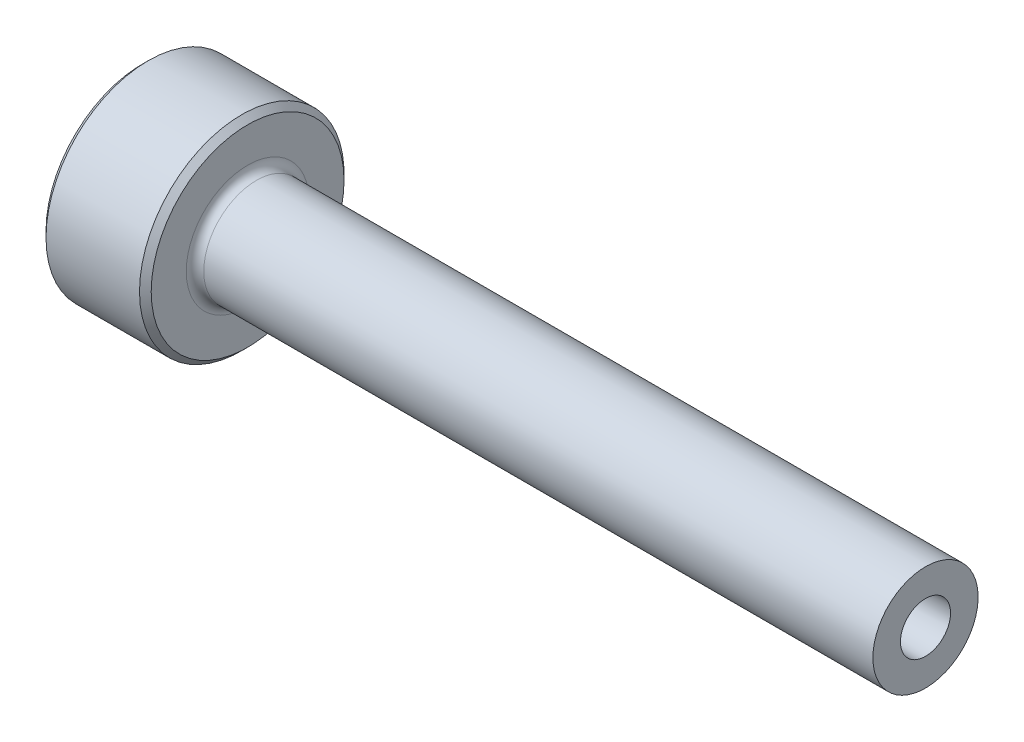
ISO-10303-21;
HEADER;
FILE_DESCRIPTION(('STEP AP214'),'2;1');
FILE_NAME('part.step','',(''),(''),'','','');
FILE_SCHEMA(('AUTOMOTIVE_DESIGN { 1 0 10303 214 1 1 1 1 }'));
ENDSEC;
DATA;
#1=APPLICATION_CONTEXT('core data for automotive mechanical design processes');
#2=APPLICATION_PROTOCOL_DEFINITION('international standard','automotive_design',2000,#1);
#3=PRODUCT_CONTEXT('',#1,'mechanical');
#4=PRODUCT('Part','Part','',(#3));
#5=PRODUCT_RELATED_PRODUCT_CATEGORY('part','',(#4));
#6=PRODUCT_DEFINITION_FORMATION('','',#4);
#7=PRODUCT_DEFINITION_CONTEXT('part definition',#1,'design');
#8=PRODUCT_DEFINITION('design','',#6,#7);
#9=PRODUCT_DEFINITION_SHAPE('','',#8);
#10=(LENGTH_UNIT() NAMED_UNIT(*) SI_UNIT(.MILLI.,.METRE.));
#11=(NAMED_UNIT(*) PLANE_ANGLE_UNIT() SI_UNIT($,.RADIAN.));
#12=(NAMED_UNIT(*) SI_UNIT($,.STERADIAN.) SOLID_ANGLE_UNIT());
#13=UNCERTAINTY_MEASURE_WITH_UNIT(LENGTH_MEASURE(1.E-05),#10,'distance_accuracy_value','');
#14=(GEOMETRIC_REPRESENTATION_CONTEXT(3) GLOBAL_UNCERTAINTY_ASSIGNED_CONTEXT((#13)) GLOBAL_UNIT_ASSIGNED_CONTEXT((#10,
#11,#12)) REPRESENTATION_CONTEXT('',''));
#15=CARTESIAN_POINT('',(0.,0.,0.));
#16=DIRECTION('',(0.,0.,1.));
#17=DIRECTION('',(1.,0.,0.));
#18=AXIS2_PLACEMENT_3D('',#15,#16,#17);
#19=CARTESIAN_POINT('',(0.,4.10062261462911,0.));
#20=DIRECTION('',(1.,0.,0.));
#21=DIRECTION('',(0.,0.,-1.));
#22=AXIS2_PLACEMENT_3D('',#19,#20,#21);
#23=PLANE('',#22);
#24=CARTESIAN_POINT('',(0.,0.,0.));
#25=DIRECTION('',(1.,0.,0.));
#26=DIRECTION('',(0.,0.,-1.));
#27=AXIS2_PLACEMENT_3D('',#24,#25,#26);
#28=CIRCLE('',#27,16.5);
#29=CARTESIAN_POINT('',(0.,0.,-16.5));
#30=VERTEX_POINT('',#29);
#31=EDGE_CURVE('E9',#30,#30,#28,.F.);
#32=ORIENTED_EDGE('',*,*,#31,.T.);
#33=EDGE_LOOP('',(#32));
#34=FACE_BOUND('',#33,.T.);
#35=CARTESIAN_POINT('',(0.,0.,0.));
#36=DIRECTION('',(-1.,0.,0.));
#37=DIRECTION('',(0.,0.,1.));
#38=AXIS2_PLACEMENT_3D('',#35,#36,#37);
#39=CIRCLE('',#38,4.10062261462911);
#40=CARTESIAN_POINT('',(0.,0.,4.10062261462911));
#41=VERTEX_POINT('',#40);
#42=EDGE_CURVE('E49',#41,#41,#39,.T.);
#43=ORIENTED_EDGE('',*,*,#42,.F.);
#44=EDGE_LOOP('',(#43));
#45=FACE_BOUND('',#44,.T.);
#46=ADVANCED_FACE('F14',(#34,#45),#23,.F.);
#47=CARTESIAN_POINT('',(0.,0.,0.));
#48=DIRECTION('',(-1.,0.,0.));
#49=DIRECTION('',(0.,0.,1.));
#50=AXIS2_PLACEMENT_3D('',#47,#48,#49);
#51=CYLINDRICAL_SURFACE('',#50,17.5);
#52=CARTESIAN_POINT('',(17.,0.,0.));
#53=DIRECTION('',(-1.,0.,0.));
#54=DIRECTION('',(0.,0.,1.));
#55=AXIS2_PLACEMENT_3D('',#52,#53,#54);
#56=CIRCLE('',#55,17.5);
#57=CARTESIAN_POINT('',(17.,0.,17.5));
#58=VERTEX_POINT('',#57);
#59=EDGE_CURVE('E25',#58,#58,#56,.T.);
#60=ORIENTED_EDGE('',*,*,#59,.T.);
#61=EDGE_LOOP('',(#60));
#62=FACE_BOUND('',#61,.T.);
#63=CARTESIAN_POINT('',(1.00000000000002,0.,0.));
#64=DIRECTION('',(1.,0.,0.));
#65=DIRECTION('',(0.,0.,-1.));
#66=AXIS2_PLACEMENT_3D('',#63,#64,#65);
#67=CIRCLE('',#66,17.5);
#68=CARTESIAN_POINT('',(1.00000000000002,0.,-17.5));
#69=VERTEX_POINT('',#68);
#70=EDGE_CURVE('E29',#69,#69,#67,.T.);
#71=ORIENTED_EDGE('',*,*,#70,.T.);
#72=EDGE_LOOP('',(#71));
#73=FACE_BOUND('',#72,.T.);
#74=ADVANCED_FACE('F56',(#62,#73),#51,.T.);
#75=CARTESIAN_POINT('',(18.,17.5,0.));
#76=DIRECTION('',(-1.,0.,0.));
#77=DIRECTION('',(0.,0.,1.));
#78=AXIS2_PLACEMENT_3D('',#75,#76,#77);
#79=PLANE('',#78);
#80=CARTESIAN_POINT('',(18.,0.,0.));
#81=DIRECTION('',(-1.,0.,0.));
#82=DIRECTION('',(0.,0.,1.));
#83=AXIS2_PLACEMENT_3D('',#80,#81,#82);
#84=CIRCLE('',#83,16.5);
#85=CARTESIAN_POINT('',(18.,0.,16.5));
#86=VERTEX_POINT('',#85);
#87=EDGE_CURVE('E21',#86,#86,#84,.F.);
#88=ORIENTED_EDGE('',*,*,#87,.T.);
#89=EDGE_LOOP('',(#88));
#90=FACE_BOUND('',#89,.T.);
#91=CARTESIAN_POINT('',(18.,0.,0.));
#92=DIRECTION('',(-1.,0.,0.));
#93=DIRECTION('',(0.,0.,1.));
#94=AXIS2_PLACEMENT_3D('',#91,#92,#93);
#95=CIRCLE('',#94,10.5);
#96=CARTESIAN_POINT('',(18.,0.,10.5));
#97=VERTEX_POINT('',#96);
#98=EDGE_CURVE('E34',#97,#97,#95,.T.);
#99=ORIENTED_EDGE('',*,*,#98,.T.);
#100=EDGE_LOOP('',(#99));
#101=FACE_BOUND('',#100,.T.);
#102=ADVANCED_FACE('F63',(#90,#101),#79,.F.);
#103=CARTESIAN_POINT('',(19.5,0.,0.));
#104=DIRECTION('',(-1.,0.,0.));
#105=DIRECTION('',(0.,0.,1.));
#106=AXIS2_PLACEMENT_3D('',#103,#104,#105);
#107=TOROIDAL_SURFACE('',#106,10.5,1.5);
#108=ORIENTED_EDGE('',*,*,#98,.F.);
#109=EDGE_LOOP('',(#108));
#110=FACE_BOUND('',#109,.T.);
#111=CARTESIAN_POINT('',(19.5,0.,0.));
#112=DIRECTION('',(-1.,0.,0.));
#113=DIRECTION('',(0.,0.,1.));
#114=AXIS2_PLACEMENT_3D('',#111,#112,#113);
#115=CIRCLE('',#114,9.);
#116=CARTESIAN_POINT('',(19.5,0.,9.));
#117=VERTEX_POINT('',#116);
#118=EDGE_CURVE('E37',#117,#117,#115,.T.);
#119=ORIENTED_EDGE('',*,*,#118,.T.);
#120=EDGE_LOOP('',(#119));
#121=FACE_BOUND('',#120,.T.);
#122=ADVANCED_FACE('F99',(#110,#121),#107,.F.);
#123=CARTESIAN_POINT('',(0.,0.,0.));
#124=DIRECTION('',(-1.,0.,0.));
#125=DIRECTION('',(0.,0.,1.));
#126=AXIS2_PLACEMENT_3D('',#123,#124,#125);
#127=CYLINDRICAL_SURFACE('',#126,9.);
#128=ORIENTED_EDGE('',*,*,#118,.F.);
#129=EDGE_LOOP('',(#128));
#130=FACE_BOUND('',#129,.T.);
#131=CARTESIAN_POINT('',(134.,0.,0.));
#132=DIRECTION('',(-1.,0.,0.));
#133=DIRECTION('',(0.,0.,1.));
#134=AXIS2_PLACEMENT_3D('',#131,#132,#133);
#135=CIRCLE('',#134,9.);
#136=CARTESIAN_POINT('',(134.,0.,9.));
#137=VERTEX_POINT('',#136);
#138=EDGE_CURVE('E40',#137,#137,#135,.T.);
#139=ORIENTED_EDGE('',*,*,#138,.T.);
#140=EDGE_LOOP('',(#139));
#141=FACE_BOUND('',#140,.T.);
#142=ADVANCED_FACE('F95',(#130,#141),#127,.T.);
#143=CARTESIAN_POINT('',(134.,4.28661350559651,0.));
#144=DIRECTION('',(-1.,0.,0.));
#145=DIRECTION('',(0.,0.,1.));
#146=AXIS2_PLACEMENT_3D('',#143,#144,#145);
#147=PLANE('',#146);
#148=ORIENTED_EDGE('',*,*,#138,.F.);
#149=EDGE_LOOP('',(#148));
#150=FACE_BOUND('',#149,.T.);
#151=CARTESIAN_POINT('',(134.,0.,0.));
#152=DIRECTION('',(-1.,0.,0.));
#153=DIRECTION('',(0.,0.,1.));
#154=AXIS2_PLACEMENT_3D('',#151,#152,#153);
#155=CIRCLE('',#154,4.28661350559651);
#156=CARTESIAN_POINT('',(134.,0.,4.28661350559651));
#157=VERTEX_POINT('',#156);
#158=EDGE_CURVE('E43',#157,#157,#155,.T.);
#159=ORIENTED_EDGE('',*,*,#158,.T.);
#160=EDGE_LOOP('',(#159));
#161=FACE_BOUND('',#160,.T.);
#162=ADVANCED_FACE('F88',(#150,#161),#147,.F.);
#163=CARTESIAN_POINT('',(3.,0.,0.));
#164=DIRECTION('',(1.,0.,0.));
#165=DIRECTION('',(0.,0.,-1.));
#166=AXIS2_PLACEMENT_3D('',#163,#164,#165);
#167=CONICAL_SURFACE('',#166,2.,0.0174532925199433);
#168=ORIENTED_EDGE('',*,*,#158,.F.);
#169=EDGE_LOOP('',(#168));
#170=FACE_BOUND('',#169,.T.);
#171=CARTESIAN_POINT('',(3.,0.,0.));
#172=DIRECTION('',(-1.,0.,0.));
#173=DIRECTION('',(0.,0.,1.));
#174=AXIS2_PLACEMENT_3D('',#171,#172,#173);
#175=CIRCLE('',#174,2.);
#176=CARTESIAN_POINT('',(3.,0.,2.));
#177=VERTEX_POINT('',#176);
#178=EDGE_CURVE('E46',#177,#177,#175,.T.);
#179=ORIENTED_EDGE('',*,*,#178,.T.);
#180=EDGE_LOOP('',(#179));
#181=FACE_BOUND('',#180,.T.);
#182=ADVANCED_FACE('F76',(#170,#181),#167,.F.);
#183=CARTESIAN_POINT('',(0.,0.,0.));
#184=DIRECTION('',(-1.,0.,0.));
#185=DIRECTION('',(0.,0.,1.));
#186=AXIS2_PLACEMENT_3D('',#183,#184,#185);
#187=CONICAL_SURFACE('',#186,4.10062261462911,0.61086523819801);
#188=ORIENTED_EDGE('',*,*,#178,.F.);
#189=EDGE_LOOP('',(#188));
#190=FACE_BOUND('',#189,.T.);
#191=ORIENTED_EDGE('',*,*,#42,.T.);
#192=EDGE_LOOP('',(#191));
#193=FACE_BOUND('',#192,.T.);
#194=ADVANCED_FACE('F53',(#190,#193),#187,.F.);
#195=CARTESIAN_POINT('',(17.,0.,0.));
#196=DIRECTION('',(-1.,0.,0.));
#197=DIRECTION('',(0.,0.,1.));
#198=AXIS2_PLACEMENT_3D('',#195,#196,#197);
#199=CONICAL_SURFACE('',#198,17.5,0.785398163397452);
#200=ORIENTED_EDGE('',*,*,#87,.F.);
#201=EDGE_LOOP('',(#200));
#202=FACE_BOUND('',#201,.T.);
#203=ORIENTED_EDGE('',*,*,#59,.F.);
#204=EDGE_LOOP('',(#203));
#205=FACE_BOUND('',#204,.T.);
#206=ADVANCED_FACE('F67',(#202,#205),#199,.T.);
#207=CARTESIAN_POINT('',(0.,0.,0.));
#208=DIRECTION('',(1.,0.,0.));
#209=DIRECTION('',(0.,0.,-1.));
#210=AXIS2_PLACEMENT_3D('',#207,#208,#209);
#211=CONICAL_SURFACE('',#210,16.5,0.785398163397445);
#212=ORIENTED_EDGE('',*,*,#70,.F.);
#213=EDGE_LOOP('',(#212));
#214=FACE_BOUND('',#213,.T.);
#215=ORIENTED_EDGE('',*,*,#31,.F.);
#216=EDGE_LOOP('',(#215));
#217=FACE_BOUND('',#216,.T.);
#218=ADVANCED_FACE('F16',(#214,#217),#211,.T.);
#219=CLOSED_SHELL('',(#46,#74,#102,#122,#142,#162,#182,#194,#206,#218));
#220=MANIFOLD_SOLID_BREP('B1',#219);
#221=ADVANCED_BREP_SHAPE_REPRESENTATION('',(#18,#220),#14);
#222=SHAPE_DEFINITION_REPRESENTATION(#9,#221);
ENDSEC;
END-ISO-10303-21;
